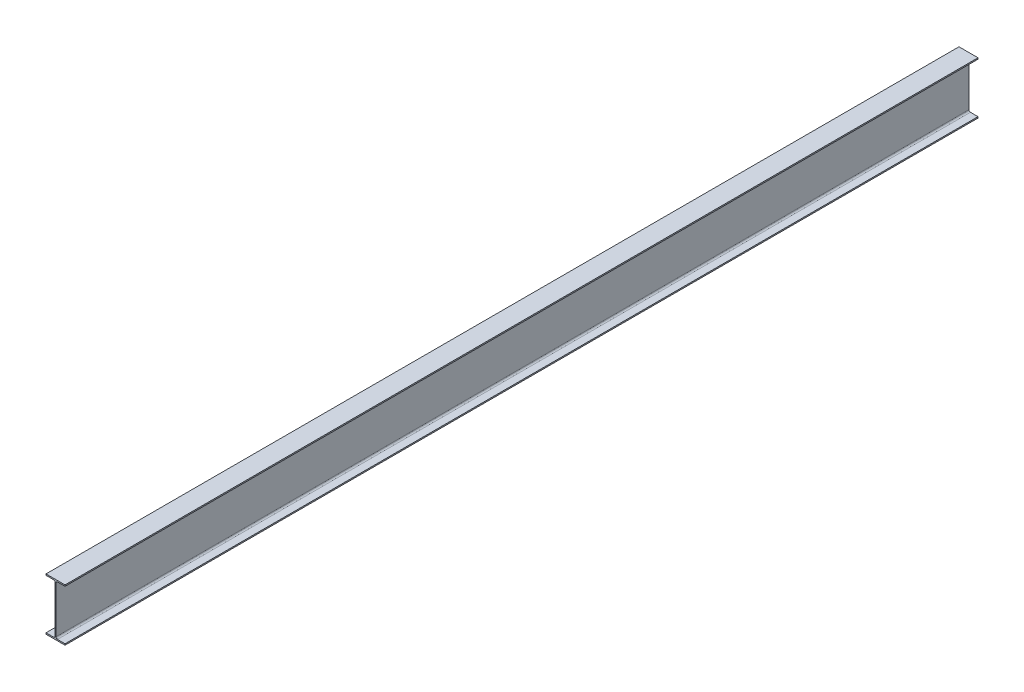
from build123d import *

# Parameters (mm, degrees)
BOSS_EXTRUDE1_DEPTH = 3048


with BuildPart() as part:
    # Sketch1 → Boss-Extrude1 (new, symmetric)
    with BuildSketch(Plane.XY):
        with BuildLine():
            Line((-63.5, -174.498), (-63.5, -165.989))
            Line((-63.5, -165.989), (-13.081, -165.989))
            ThreePointArc((-13.081, -165.989), (-5.896795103, -163.013204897), (-2.921, -155.829))
            Line((-2.921, -155.829), (-2.921, 155.829))
            ThreePointArc((-2.921, 155.829), (-5.896795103, 163.013204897), (-13.081, 165.989))
            Line((-13.081, 165.989), (-63.5, 165.989))
            Line((-63.5, 165.989), (-63.5, 174.498))
            Line((-63.5, 174.498), (63.5, 174.498))
            Line((63.5, 174.498), (63.5, 165.989))
            Line((63.5, 165.989), (13.081, 165.989))
            ThreePointArc((13.081, 165.989), (5.896795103, 163.013204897), (2.921, 155.829))
            Line((2.921, 155.829), (2.921, -155.829))
            ThreePointArc((2.921, -155.829), (5.896795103, -163.013204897), (13.081, -165.989))
            Line((13.081, -165.989), (63.5, -165.989))
            Line((63.5, -165.989), (63.5, -174.498))
            Line((63.5, -174.498), (-63.5, -174.498))
        make_face()
    extrude(amount=BOSS_EXTRUDE1_DEPTH, both=True)


solid = part.part
